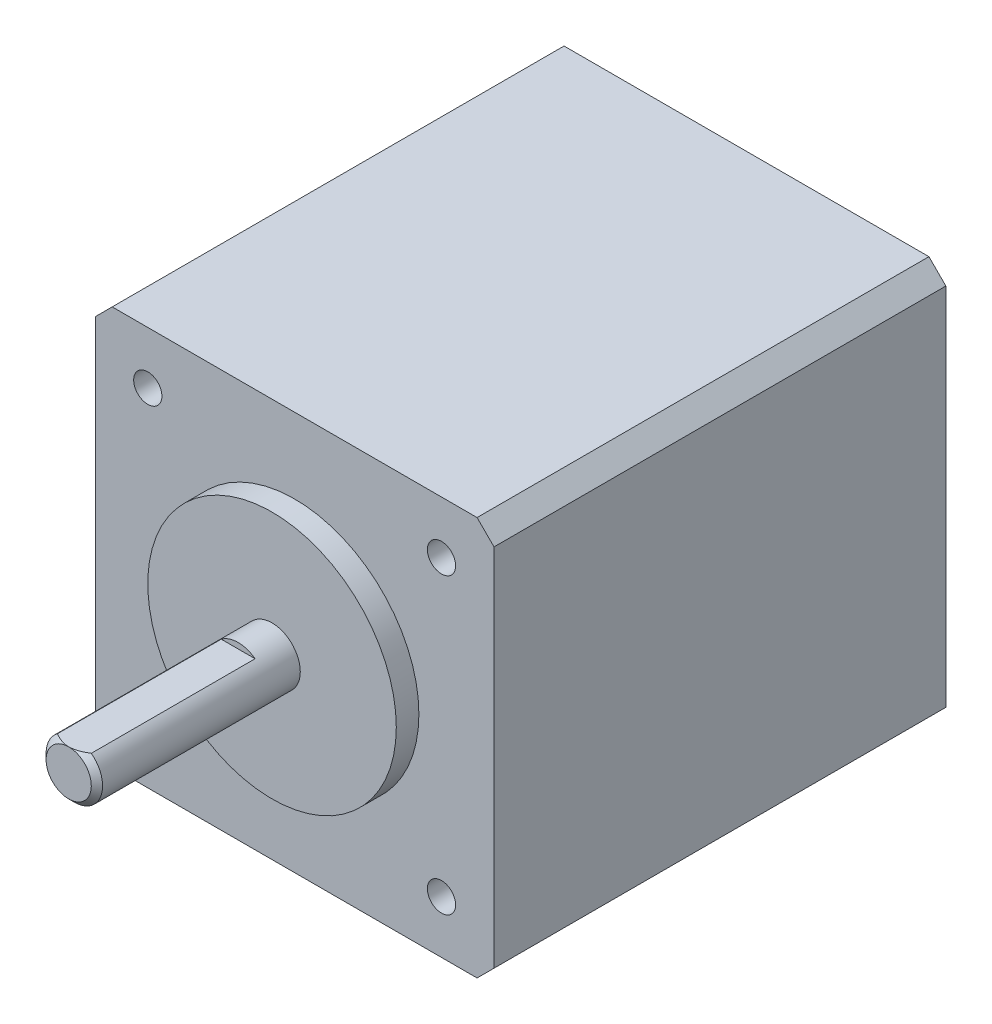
ISO-10303-21;
HEADER;
FILE_DESCRIPTION(('STEP AP214'),'2;1');
FILE_NAME('part.step','',(''),(''),'','','');
FILE_SCHEMA(('AUTOMOTIVE_DESIGN { 1 0 10303 214 1 1 1 1 }'));
ENDSEC;
DATA;
#1=APPLICATION_CONTEXT('core data for automotive mechanical design processes');
#2=APPLICATION_PROTOCOL_DEFINITION('international standard','automotive_design',2000,#1);
#3=PRODUCT_CONTEXT('',#1,'mechanical');
#4=PRODUCT('Part','Part','',(#3));
#5=PRODUCT_RELATED_PRODUCT_CATEGORY('part','',(#4));
#6=PRODUCT_DEFINITION_FORMATION('','',#4);
#7=PRODUCT_DEFINITION_CONTEXT('part definition',#1,'design');
#8=PRODUCT_DEFINITION('design','',#6,#7);
#9=PRODUCT_DEFINITION_SHAPE('','',#8);
#10=(LENGTH_UNIT() NAMED_UNIT(*) SI_UNIT(.MILLI.,.METRE.));
#11=(NAMED_UNIT(*) PLANE_ANGLE_UNIT() SI_UNIT($,.RADIAN.));
#12=(NAMED_UNIT(*) SI_UNIT($,.STERADIAN.) SOLID_ANGLE_UNIT());
#13=UNCERTAINTY_MEASURE_WITH_UNIT(LENGTH_MEASURE(1.E-05),#10,'distance_accuracy_value','');
#14=(GEOMETRIC_REPRESENTATION_CONTEXT(3) GLOBAL_UNCERTAINTY_ASSIGNED_CONTEXT((#13)) GLOBAL_UNIT_ASSIGNED_CONTEXT((#10,
#11,#12)) REPRESENTATION_CONTEXT('',''));
#15=CARTESIAN_POINT('',(0.,0.,0.));
#16=DIRECTION('',(0.,0.,1.));
#17=DIRECTION('',(1.,0.,0.));
#18=AXIS2_PLACEMENT_3D('',#15,#16,#17);
#19=CARTESIAN_POINT('',(0.,0.,0.));
#20=DIRECTION('',(0.,0.,1.));
#21=DIRECTION('',(1.,0.,0.));
#22=AXIS2_PLACEMENT_3D('',#19,#20,#21);
#23=PLANE('',#22);
#24=CARTESIAN_POINT('',(0.,0.,0.));
#25=DIRECTION('',(0.,0.,1.));
#26=DIRECTION('',(1.,0.,0.));
#27=AXIS2_PLACEMENT_3D('',#24,#25,#26);
#28=CIRCLE('',#27,11.);
#29=CARTESIAN_POINT('',(11.,0.,0.));
#30=VERTEX_POINT('',#29);
#31=EDGE_CURVE('E232',#30,#30,#28,.T.);
#32=ORIENTED_EDGE('',*,*,#31,.T.);
#33=EDGE_LOOP('',(#32));
#34=FACE_BOUND('',#33,.T.);
#35=CARTESIAN_POINT('',(0.,0.,0.));
#36=DIRECTION('',(0.,0.,1.));
#37=DIRECTION('',(1.,0.,0.));
#38=AXIS2_PLACEMENT_3D('',#35,#36,#37);
#39=CIRCLE('',#38,2.5);
#40=CARTESIAN_POINT('',(2.5,0.,0.));
#41=VERTEX_POINT('',#40);
#42=EDGE_CURVE('E229',#41,#41,#39,.T.);
#43=ORIENTED_EDGE('',*,*,#42,.F.);
#44=EDGE_LOOP('',(#43));
#45=FACE_BOUND('',#44,.T.);
#46=ADVANCED_FACE('F39',(#34,#45),#23,.T.);
#47=CARTESIAN_POINT('',(0.,0.,-2.));
#48=DIRECTION('',(0.,0.,1.));
#49=DIRECTION('',(1.,0.,0.));
#50=AXIS2_PLACEMENT_3D('',#47,#48,#49);
#51=CYLINDRICAL_SURFACE('',#50,11.);
#52=CARTESIAN_POINT('',(0.,0.,-2.));
#53=DIRECTION('',(0.,0.,1.));
#54=DIRECTION('',(1.,0.,0.));
#55=AXIS2_PLACEMENT_3D('',#52,#53,#54);
#56=CIRCLE('',#55,11.);
#57=CARTESIAN_POINT('',(11.,0.,-2.));
#58=VERTEX_POINT('',#57);
#59=EDGE_CURVE('E219',#58,#58,#56,.F.);
#60=ORIENTED_EDGE('',*,*,#59,.F.);
#61=EDGE_LOOP('',(#60));
#62=FACE_BOUND('',#61,.T.);
#63=ORIENTED_EDGE('',*,*,#31,.F.);
#64=EDGE_LOOP('',(#63));
#65=FACE_BOUND('',#64,.T.);
#66=ADVANCED_FACE('F265',(#62,#65),#51,.T.);
#67=CARTESIAN_POINT('',(0.,0.,18.));
#68=DIRECTION('',(0.,0.,-1.));
#69=DIRECTION('',(-1.,0.,0.));
#70=AXIS2_PLACEMENT_3D('',#67,#68,#69);
#71=CYLINDRICAL_SURFACE('',#70,2.5);
#72=DIRECTION('',(0.,0.,-1.));
#73=VECTOR('',#72,1.);
#74=CARTESIAN_POINT('',(1.5,2.,18.));
#75=LINE('',#74,#73);
#76=CARTESIAN_POINT('',(1.5,2.,3.));
#77=VERTEX_POINT('',#76);
#78=CARTESIAN_POINT('',(1.5,2.,17.5));
#79=VERTEX_POINT('',#78);
#80=EDGE_CURVE('E225',#77,#79,#75,.F.);
#81=ORIENTED_EDGE('',*,*,#80,.T.);
#82=CARTESIAN_POINT('',(0.,0.,17.5));
#83=DIRECTION('',(0.,0.,1.));
#84=DIRECTION('',(1.,0.,0.));
#85=AXIS2_PLACEMENT_3D('',#82,#83,#84);
#86=CIRCLE('',#85,2.5);
#87=CARTESIAN_POINT('',(-1.5,2.,17.5));
#88=VERTEX_POINT('',#87);
#89=EDGE_CURVE('E11',#79,#88,#86,.F.);
#90=ORIENTED_EDGE('',*,*,#89,.T.);
#91=DIRECTION('',(0.,0.,-1.));
#92=VECTOR('',#91,1.);
#93=CARTESIAN_POINT('',(-1.5,2.,18.));
#94=LINE('',#93,#92);
#95=CARTESIAN_POINT('',(-1.5,2.,3.));
#96=VERTEX_POINT('',#95);
#97=EDGE_CURVE('E227',#88,#96,#94,.T.);
#98=ORIENTED_EDGE('',*,*,#97,.T.);
#99=CARTESIAN_POINT('',(0.,0.,3.));
#100=DIRECTION('',(0.,0.,1.));
#101=DIRECTION('',(1.,0.,0.));
#102=AXIS2_PLACEMENT_3D('',#99,#100,#101);
#103=CIRCLE('',#102,2.5);
#104=EDGE_CURVE('E235',#77,#96,#103,.T.);
#105=ORIENTED_EDGE('',*,*,#104,.F.);
#106=EDGE_LOOP('',(#81,#90,#98,#105));
#107=FACE_BOUND('',#106,.T.);
#108=ORIENTED_EDGE('',*,*,#42,.T.);
#109=EDGE_LOOP('',(#108));
#110=FACE_BOUND('',#109,.T.);
#111=ADVANCED_FACE('F261',(#107,#110),#71,.T.);
#112=CARTESIAN_POINT('',(0.,0.,18.));
#113=DIRECTION('',(0.,0.,1.));
#114=DIRECTION('',(1.,0.,0.));
#115=AXIS2_PLACEMENT_3D('',#112,#113,#114);
#116=PLANE('',#115);
#117=CARTESIAN_POINT('',(0.,0.,18.));
#118=DIRECTION('',(0.,0.,1.));
#119=DIRECTION('',(1.,0.,0.));
#120=AXIS2_PLACEMENT_3D('',#117,#118,#119);
#121=CIRCLE('',#120,1.99999999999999);
#122=CARTESIAN_POINT('',(0.,2.,18.));
#123=VERTEX_POINT('',#122);
#124=EDGE_CURVE('E238',#123,#123,#121,.T.);
#125=ORIENTED_EDGE('',*,*,#124,.T.);
#126=EDGE_LOOP('',(#125));
#127=FACE_BOUND('',#126,.T.);
#128=ADVANCED_FACE('F257',(#127),#116,.T.);
#129=CARTESIAN_POINT('',(0.,0.,3.));
#130=DIRECTION('',(0.,0.,1.));
#131=DIRECTION('',(1.,0.,0.));
#132=AXIS2_PLACEMENT_3D('',#129,#130,#131);
#133=PLANE('',#132);
#134=ORIENTED_EDGE('',*,*,#104,.T.);
#135=DIRECTION('',(1.,0.,0.));
#136=VECTOR('',#135,1.);
#137=CARTESIAN_POINT('',(-3.25447574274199,2.,3.));
#138=LINE('',#137,#136);
#139=EDGE_CURVE('E222',#96,#77,#138,.T.);
#140=ORIENTED_EDGE('',*,*,#139,.T.);
#141=EDGE_LOOP('',(#134,#140));
#142=FACE_BOUND('',#141,.T.);
#143=ADVANCED_FACE('F255',(#142),#133,.T.);
#144=CARTESIAN_POINT('',(0.,2.,3.));
#145=DIRECTION('',(0.,-1.,0.));
#146=DIRECTION('',(0.,0.,-1.));
#147=AXIS2_PLACEMENT_3D('',#144,#145,#146);
#148=PLANE('',#147);
#149=CARTESIAN_POINT('',(-1.5,2.,17.5));
#150=CARTESIAN_POINT('',(-1.42763018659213,2.,17.5433736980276));
#151=CARTESIAN_POINT('',(-1.35436226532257,2.,17.5853687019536));
#152=CARTESIAN_POINT('',(-1.20549660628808,2.,17.6656443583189));
#153=CARTESIAN_POINT('',(-1.12989157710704,2.,17.7039114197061));
#154=CARTESIAN_POINT('',(-0.978296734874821,2.,17.774534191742));
#155=CARTESIAN_POINT('',(-0.902366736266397,2.,17.8070165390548));
#156=CARTESIAN_POINT('',(-0.748220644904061,2.,17.8658090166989));
#157=CARTESIAN_POINT('',(-0.67000787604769,2.,17.8921276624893));
#158=CARTESIAN_POINT('',(-0.543060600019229,2.,17.9280861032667));
#159=CARTESIAN_POINT('',(-0.495021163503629,2.,17.9401901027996));
#160=CARTESIAN_POINT('',(-0.398260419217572,2.,17.9612794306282));
#161=CARTESIAN_POINT('',(-0.349539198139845,2.,17.9702651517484));
#162=CARTESIAN_POINT('',(-0.250852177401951,2.,17.984927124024));
#163=CARTESIAN_POINT('',(-0.200878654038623,2.,17.9905520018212));
#164=CARTESIAN_POINT('',(-0.100607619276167,2.,17.9981023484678));
#165=CARTESIAN_POINT('',(-0.0503098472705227,2.,18.0000243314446));
#166=CARTESIAN_POINT('',(0.,2.,18.));
#167=B_SPLINE_CURVE_WITH_KNOTS('',3,(#149,#150,#151,#152,#153,#154,#155,#156,#157,#158,#159,
#160,#161,#162,#163,#164,#165,#166),.UNSPECIFIED.,.F.,.F.,(4,2,2,2,2,2,2,2,4),(0.,
0.2531950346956,0.507281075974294,0.754837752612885,1.00205037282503,1.15058504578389,
1.29910100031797,1.44983263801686,1.60070610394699),.UNSPECIFIED.);
#168=EDGE_CURVE('E241',#88,#123,#167,.T.);
#169=ORIENTED_EDGE('',*,*,#168,.T.);
#170=CARTESIAN_POINT('',(0.,1.99999999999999,18.));
#171=CARTESIAN_POINT('',(0.0614966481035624,2.,18.0000514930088));
#172=CARTESIAN_POINT('',(0.12296179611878,2.,17.997164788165));
#173=CARTESIAN_POINT('',(0.245274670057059,2.,17.9859212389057));
#174=CARTESIAN_POINT('',(0.30612336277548,2.,17.9775750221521));
#175=CARTESIAN_POINT('',(0.425885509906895,2.,17.9559969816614));
#176=CARTESIAN_POINT('',(0.484814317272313,2.,17.9428488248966));
#177=CARTESIAN_POINT('',(0.60155552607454,2.,17.9122507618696));
#178=CARTESIAN_POINT('',(0.659367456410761,2.,17.8947990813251));
#179=CARTESIAN_POINT('',(0.78457626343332,2.,17.8525702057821));
#180=CARTESIAN_POINT('',(0.851714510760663,2.,17.8270315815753));
#181=CARTESIAN_POINT('',(0.984250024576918,2.,17.7717452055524));
#182=CARTESIAN_POINT('',(1.04964642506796,2.,17.7419954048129));
#183=CARTESIAN_POINT('',(1.18016546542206,2.,17.6784785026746));
#184=CARTESIAN_POINT('',(1.24525271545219,2.,17.6446394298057));
#185=CARTESIAN_POINT('',(1.37378197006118,2.,17.5742160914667));
#186=CARTESIAN_POINT('',(1.43722666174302,2.,17.5376367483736));
#187=CARTESIAN_POINT('',(1.5,2.,17.5));
#188=B_SPLINE_CURVE_WITH_KNOTS('',3,(#170,#171,#172,#173,#174,#175,#176,#177,#178,#179,#180,
#181,#182,#183,#184,#185,#186,#187),.UNSPECIFIED.,.F.,.F.,(4,2,2,2,2,2,2,2,4),(0.,
0.184371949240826,0.36838605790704,0.549336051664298,0.730360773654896,0.945674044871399,
1.16109243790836,1.38109142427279,1.60070428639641),.UNSPECIFIED.);
#189=EDGE_CURVE('E48',#123,#79,#188,.T.);
#190=ORIENTED_EDGE('',*,*,#189,.T.);
#191=ORIENTED_EDGE('',*,*,#80,.F.);
#192=ORIENTED_EDGE('',*,*,#139,.F.);
#193=ORIENTED_EDGE('',*,*,#97,.F.);
#194=EDGE_LOOP('',(#169,#190,#191,#192,#193));
#195=FACE_BOUND('',#194,.T.);
#196=ADVANCED_FACE('F249',(#195),#148,.F.);
#197=CARTESIAN_POINT('',(17.65,-16.15,-42.));
#198=DIRECTION('',(-1.,0.,0.));
#199=DIRECTION('',(0.,0.,1.));
#200=AXIS2_PLACEMENT_3D('',#197,#198,#199);
#201=PLANE('',#200);
#202=DIRECTION('',(0.,-1.,0.));
#203=VECTOR('',#202,1.);
#204=CARTESIAN_POINT('',(17.65,-16.15,-2.));
#205=LINE('',#204,#203);
#206=CARTESIAN_POINT('',(17.65,16.15,-2.));
#207=VERTEX_POINT('',#206);
#208=CARTESIAN_POINT('',(17.65,-16.15,-2.));
#209=VERTEX_POINT('',#208);
#210=EDGE_CURVE('E160',#207,#209,#205,.T.);
#211=ORIENTED_EDGE('',*,*,#210,.T.);
#212=DIRECTION('',(0.,0.,1.));
#213=VECTOR('',#212,1.);
#214=CARTESIAN_POINT('',(17.65,-16.15,-42.));
#215=LINE('',#214,#213);
#216=CARTESIAN_POINT('',(17.65,-16.15,-42.));
#217=VERTEX_POINT('',#216);
#218=EDGE_CURVE('E216',#217,#209,#215,.T.);
#219=ORIENTED_EDGE('',*,*,#218,.F.);
#220=DIRECTION('',(0.,-1.,0.));
#221=VECTOR('',#220,1.);
#222=CARTESIAN_POINT('',(17.65,-16.15,-42.));
#223=LINE('',#222,#221);
#224=CARTESIAN_POINT('',(17.65,16.15,-42.));
#225=VERTEX_POINT('',#224);
#226=EDGE_CURVE('E161',#225,#217,#223,.T.);
#227=ORIENTED_EDGE('',*,*,#226,.F.);
#228=DIRECTION('',(0.,0.,1.));
#229=VECTOR('',#228,1.);
#230=CARTESIAN_POINT('',(17.65,16.15,-42.));
#231=LINE('',#230,#229);
#232=EDGE_CURVE('E179',#225,#207,#231,.T.);
#233=ORIENTED_EDGE('',*,*,#232,.T.);
#234=EDGE_LOOP('',(#211,#219,#227,#233));
#235=FACE_BOUND('',#234,.T.);
#236=ADVANCED_FACE('F254',(#235),#201,.F.);
#237=CARTESIAN_POINT('',(16.15,-17.65,-42.));
#238=DIRECTION('',(-0.707106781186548,0.707106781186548,0.));
#239=DIRECTION('',(-0.707106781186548,-0.707106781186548,0.));
#240=AXIS2_PLACEMENT_3D('',#237,#238,#239);
#241=PLANE('',#240);
#242=DIRECTION('',(-0.707106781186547,-0.707106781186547,0.));
#243=VECTOR('',#242,1.);
#244=CARTESIAN_POINT('',(16.15,-17.65,-2.));
#245=LINE('',#244,#243);
#246=CARTESIAN_POINT('',(16.15,-17.65,-2.));
#247=VERTEX_POINT('',#246);
#248=EDGE_CURVE('E182',#209,#247,#245,.T.);
#249=ORIENTED_EDGE('',*,*,#248,.T.);
#250=DIRECTION('',(0.,0.,1.));
#251=VECTOR('',#250,1.);
#252=CARTESIAN_POINT('',(16.15,-17.65,-42.));
#253=LINE('',#252,#251);
#254=CARTESIAN_POINT('',(16.15,-17.65,-42.));
#255=VERTEX_POINT('',#254);
#256=EDGE_CURVE('E213',#255,#247,#253,.T.);
#257=ORIENTED_EDGE('',*,*,#256,.F.);
#258=DIRECTION('',(-0.707106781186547,-0.707106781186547,0.));
#259=VECTOR('',#258,1.);
#260=CARTESIAN_POINT('',(16.15,-17.65,-42.));
#261=LINE('',#260,#259);
#262=EDGE_CURVE('E164',#217,#255,#261,.T.);
#263=ORIENTED_EDGE('',*,*,#262,.F.);
#264=ORIENTED_EDGE('',*,*,#218,.T.);
#265=EDGE_LOOP('',(#249,#257,#263,#264));
#266=FACE_BOUND('',#265,.T.);
#267=ADVANCED_FACE('F321',(#266),#241,.F.);
#268=CARTESIAN_POINT('',(-16.15,-17.65,-42.));
#269=DIRECTION('',(0.,1.,0.));
#270=DIRECTION('',(-1.,0.,0.));
#271=AXIS2_PLACEMENT_3D('',#268,#269,#270);
#272=PLANE('',#271);
#273=DIRECTION('',(-1.,0.,0.));
#274=VECTOR('',#273,1.);
#275=CARTESIAN_POINT('',(-16.15,-17.65,-2.));
#276=LINE('',#275,#274);
#277=CARTESIAN_POINT('',(-16.15,-17.65,-2.));
#278=VERTEX_POINT('',#277);
#279=EDGE_CURVE('E184',#247,#278,#276,.T.);
#280=ORIENTED_EDGE('',*,*,#279,.T.);
#281=DIRECTION('',(0.,0.,1.));
#282=VECTOR('',#281,1.);
#283=CARTESIAN_POINT('',(-16.15,-17.65,-42.));
#284=LINE('',#283,#282);
#285=CARTESIAN_POINT('',(-16.15,-17.65,-42.));
#286=VERTEX_POINT('',#285);
#287=EDGE_CURVE('E210',#286,#278,#284,.T.);
#288=ORIENTED_EDGE('',*,*,#287,.F.);
#289=DIRECTION('',(-1.,0.,0.));
#290=VECTOR('',#289,1.);
#291=CARTESIAN_POINT('',(-16.15,-17.65,-42.));
#292=LINE('',#291,#290);
#293=EDGE_CURVE('E167',#255,#286,#292,.T.);
#294=ORIENTED_EDGE('',*,*,#293,.F.);
#295=ORIENTED_EDGE('',*,*,#256,.T.);
#296=EDGE_LOOP('',(#280,#288,#294,#295));
#297=FACE_BOUND('',#296,.T.);
#298=ADVANCED_FACE('F318',(#297),#272,.F.);
#299=CARTESIAN_POINT('',(-17.65,-16.15,-42.));
#300=DIRECTION('',(0.707106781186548,0.707106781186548,0.));
#301=DIRECTION('',(-0.707106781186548,0.707106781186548,0.));
#302=AXIS2_PLACEMENT_3D('',#299,#300,#301);
#303=PLANE('',#302);
#304=DIRECTION('',(-0.707106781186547,0.707106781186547,0.));
#305=VECTOR('',#304,1.);
#306=CARTESIAN_POINT('',(-17.65,-16.15,-2.));
#307=LINE('',#306,#305);
#308=CARTESIAN_POINT('',(-17.65,-16.15,-2.));
#309=VERTEX_POINT('',#308);
#310=EDGE_CURVE('E186',#278,#309,#307,.T.);
#311=ORIENTED_EDGE('',*,*,#310,.T.);
#312=DIRECTION('',(0.,0.,1.));
#313=VECTOR('',#312,1.);
#314=CARTESIAN_POINT('',(-17.65,-16.15,-42.));
#315=LINE('',#314,#313);
#316=CARTESIAN_POINT('',(-17.65,-16.15,-42.));
#317=VERTEX_POINT('',#316);
#318=EDGE_CURVE('E207',#317,#309,#315,.T.);
#319=ORIENTED_EDGE('',*,*,#318,.F.);
#320=DIRECTION('',(-0.707106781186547,0.707106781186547,0.));
#321=VECTOR('',#320,1.);
#322=CARTESIAN_POINT('',(-17.65,-16.15,-42.));
#323=LINE('',#322,#321);
#324=EDGE_CURVE('E169',#286,#317,#323,.T.);
#325=ORIENTED_EDGE('',*,*,#324,.F.);
#326=ORIENTED_EDGE('',*,*,#287,.T.);
#327=EDGE_LOOP('',(#311,#319,#325,#326));
#328=FACE_BOUND('',#327,.T.);
#329=ADVANCED_FACE('F313',(#328),#303,.F.);
#330=CARTESIAN_POINT('',(-17.65,16.15,-42.));
#331=DIRECTION('',(1.,0.,0.));
#332=DIRECTION('',(0.,1.,0.));
#333=AXIS2_PLACEMENT_3D('',#330,#331,#332);
#334=PLANE('',#333);
#335=DIRECTION('',(0.,1.,0.));
#336=VECTOR('',#335,1.);
#337=CARTESIAN_POINT('',(-17.65,16.15,-2.));
#338=LINE('',#337,#336);
#339=CARTESIAN_POINT('',(-17.65,16.15,-2.));
#340=VERTEX_POINT('',#339);
#341=EDGE_CURVE('E188',#309,#340,#338,.T.);
#342=ORIENTED_EDGE('',*,*,#341,.T.);
#343=DIRECTION('',(0.,0.,1.));
#344=VECTOR('',#343,1.);
#345=CARTESIAN_POINT('',(-17.65,16.15,-42.));
#346=LINE('',#345,#344);
#347=CARTESIAN_POINT('',(-17.65,16.15,-42.));
#348=VERTEX_POINT('',#347);
#349=EDGE_CURVE('E204',#348,#340,#346,.T.);
#350=ORIENTED_EDGE('',*,*,#349,.F.);
#351=DIRECTION('',(0.,1.,0.));
#352=VECTOR('',#351,1.);
#353=CARTESIAN_POINT('',(-17.65,16.15,-42.));
#354=LINE('',#353,#352);
#355=EDGE_CURVE('E171',#317,#348,#354,.T.);
#356=ORIENTED_EDGE('',*,*,#355,.F.);
#357=ORIENTED_EDGE('',*,*,#318,.T.);
#358=EDGE_LOOP('',(#342,#350,#356,#357));
#359=FACE_BOUND('',#358,.T.);
#360=ADVANCED_FACE('F309',(#359),#334,.F.);
#361=CARTESIAN_POINT('',(-16.15,17.65,-42.));
#362=DIRECTION('',(0.707106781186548,-0.707106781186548,0.));
#363=DIRECTION('',(0.707106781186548,0.707106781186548,0.));
#364=AXIS2_PLACEMENT_3D('',#361,#362,#363);
#365=PLANE('',#364);
#366=DIRECTION('',(0.707106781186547,0.707106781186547,0.));
#367=VECTOR('',#366,1.);
#368=CARTESIAN_POINT('',(-16.15,17.65,-2.));
#369=LINE('',#368,#367);
#370=CARTESIAN_POINT('',(-16.15,17.65,-2.));
#371=VERTEX_POINT('',#370);
#372=EDGE_CURVE('E190',#340,#371,#369,.T.);
#373=ORIENTED_EDGE('',*,*,#372,.T.);
#374=DIRECTION('',(0.,0.,1.));
#375=VECTOR('',#374,1.);
#376=CARTESIAN_POINT('',(-16.15,17.65,-42.));
#377=LINE('',#376,#375);
#378=CARTESIAN_POINT('',(-16.15,17.65,-42.));
#379=VERTEX_POINT('',#378);
#380=EDGE_CURVE('E201',#379,#371,#377,.T.);
#381=ORIENTED_EDGE('',*,*,#380,.F.);
#382=DIRECTION('',(0.707106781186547,0.707106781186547,0.));
#383=VECTOR('',#382,1.);
#384=CARTESIAN_POINT('',(-16.15,17.65,-42.));
#385=LINE('',#384,#383);
#386=EDGE_CURVE('E173',#348,#379,#385,.T.);
#387=ORIENTED_EDGE('',*,*,#386,.F.);
#388=ORIENTED_EDGE('',*,*,#349,.T.);
#389=EDGE_LOOP('',(#373,#381,#387,#388));
#390=FACE_BOUND('',#389,.T.);
#391=ADVANCED_FACE('F304',(#390),#365,.F.);
#392=CARTESIAN_POINT('',(16.15,17.65,-42.));
#393=DIRECTION('',(0.,-1.,0.));
#394=DIRECTION('',(1.,0.,0.));
#395=AXIS2_PLACEMENT_3D('',#392,#393,#394);
#396=PLANE('',#395);
#397=DIRECTION('',(1.,0.,0.));
#398=VECTOR('',#397,1.);
#399=CARTESIAN_POINT('',(16.15,17.65,-2.));
#400=LINE('',#399,#398);
#401=CARTESIAN_POINT('',(16.15,17.65,-2.));
#402=VERTEX_POINT('',#401);
#403=EDGE_CURVE('E193',#371,#402,#400,.T.);
#404=ORIENTED_EDGE('',*,*,#403,.T.);
#405=DIRECTION('',(0.,0.,1.));
#406=VECTOR('',#405,1.);
#407=CARTESIAN_POINT('',(16.15,17.65,-42.));
#408=LINE('',#407,#406);
#409=CARTESIAN_POINT('',(16.15,17.65,-42.));
#410=VERTEX_POINT('',#409);
#411=EDGE_CURVE('E198',#410,#402,#408,.T.);
#412=ORIENTED_EDGE('',*,*,#411,.F.);
#413=DIRECTION('',(1.,0.,0.));
#414=VECTOR('',#413,1.);
#415=CARTESIAN_POINT('',(0.,17.65,-42.));
#416=LINE('',#415,#414);
#417=EDGE_CURVE('E175',#379,#410,#416,.T.);
#418=ORIENTED_EDGE('',*,*,#417,.F.);
#419=ORIENTED_EDGE('',*,*,#380,.T.);
#420=EDGE_LOOP('',(#404,#412,#418,#419));
#421=FACE_BOUND('',#420,.T.);
#422=ADVANCED_FACE('F299',(#421),#396,.F.);
#423=CARTESIAN_POINT('',(17.65,16.15,-42.));
#424=DIRECTION('',(-0.707106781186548,-0.707106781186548,0.));
#425=DIRECTION('',(0.707106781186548,-0.707106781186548,0.));
#426=AXIS2_PLACEMENT_3D('',#423,#424,#425);
#427=PLANE('',#426);
#428=DIRECTION('',(0.707106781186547,-0.707106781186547,0.));
#429=VECTOR('',#428,1.);
#430=CARTESIAN_POINT('',(17.65,16.15,-2.));
#431=LINE('',#430,#429);
#432=EDGE_CURVE('E165',#402,#207,#431,.T.);
#433=ORIENTED_EDGE('',*,*,#432,.T.);
#434=ORIENTED_EDGE('',*,*,#232,.F.);
#435=DIRECTION('',(0.707106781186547,-0.707106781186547,0.));
#436=VECTOR('',#435,1.);
#437=CARTESIAN_POINT('',(17.65,16.15,-42.));
#438=LINE('',#437,#436);
#439=EDGE_CURVE('E177',#410,#225,#438,.T.);
#440=ORIENTED_EDGE('',*,*,#439,.F.);
#441=ORIENTED_EDGE('',*,*,#411,.T.);
#442=EDGE_LOOP('',(#433,#434,#440,#441));
#443=FACE_BOUND('',#442,.T.);
#444=ADVANCED_FACE('F295',(#443),#427,.F.);
#445=CARTESIAN_POINT('',(0.,0.,-42.));
#446=DIRECTION('',(0.,0.,1.));
#447=DIRECTION('',(1.,0.,0.));
#448=AXIS2_PLACEMENT_3D('',#445,#446,#447);
#449=PLANE('',#448);
#450=ORIENTED_EDGE('',*,*,#226,.T.);
#451=ORIENTED_EDGE('',*,*,#262,.T.);
#452=ORIENTED_EDGE('',*,*,#293,.T.);
#453=ORIENTED_EDGE('',*,*,#324,.T.);
#454=ORIENTED_EDGE('',*,*,#355,.T.);
#455=ORIENTED_EDGE('',*,*,#386,.T.);
#456=ORIENTED_EDGE('',*,*,#417,.T.);
#457=ORIENTED_EDGE('',*,*,#439,.T.);
#458=EDGE_LOOP('',(#450,#451,#452,#453,#454,#455,#456,#457));
#459=FACE_BOUND('',#458,.T.);
#460=ADVANCED_FACE('F283',(#459),#449,.F.);
#461=CARTESIAN_POINT('',(0.,0.,-2.));
#462=DIRECTION('',(0.,0.,1.));
#463=DIRECTION('',(1.,0.,0.));
#464=AXIS2_PLACEMENT_3D('',#461,#462,#463);
#465=PLANE('',#464);
#466=CARTESIAN_POINT('',(-13.,13.,-2.));
#467=DIRECTION('',(0.,0.,1.));
#468=DIRECTION('',(1.,0.,0.));
#469=AXIS2_PLACEMENT_3D('',#466,#467,#468);
#470=CIRCLE('',#469,1.25);
#471=CARTESIAN_POINT('',(-11.75,13.,-2.));
#472=VERTEX_POINT('',#471);
#473=EDGE_CURVE('E138',#472,#472,#470,.T.);
#474=ORIENTED_EDGE('',*,*,#473,.F.);
#475=EDGE_LOOP('',(#474));
#476=FACE_BOUND('',#475,.T.);
#477=CARTESIAN_POINT('',(13.,13.,-2.));
#478=DIRECTION('',(0.,0.,1.));
#479=DIRECTION('',(1.,0.,0.));
#480=AXIS2_PLACEMENT_3D('',#477,#478,#479);
#481=CIRCLE('',#480,1.25);
#482=CARTESIAN_POINT('',(14.25,13.,-2.));
#483=VERTEX_POINT('',#482);
#484=EDGE_CURVE('E137',#483,#483,#481,.T.);
#485=ORIENTED_EDGE('',*,*,#484,.F.);
#486=EDGE_LOOP('',(#485));
#487=FACE_BOUND('',#486,.T.);
#488=CARTESIAN_POINT('',(13.,-13.,-2.));
#489=DIRECTION('',(0.,0.,1.));
#490=DIRECTION('',(1.,0.,0.));
#491=AXIS2_PLACEMENT_3D('',#488,#489,#490);
#492=CIRCLE('',#491,1.25);
#493=CARTESIAN_POINT('',(14.25,-13.,-2.));
#494=VERTEX_POINT('',#493);
#495=EDGE_CURVE('E148',#494,#494,#492,.T.);
#496=ORIENTED_EDGE('',*,*,#495,.F.);
#497=EDGE_LOOP('',(#496));
#498=FACE_BOUND('',#497,.T.);
#499=CARTESIAN_POINT('',(-13.,-13.,-2.));
#500=DIRECTION('',(0.,0.,1.));
#501=DIRECTION('',(1.,0.,0.));
#502=AXIS2_PLACEMENT_3D('',#499,#500,#501);
#503=CIRCLE('',#502,1.25);
#504=CARTESIAN_POINT('',(-11.75,-13.,-2.));
#505=VERTEX_POINT('',#504);
#506=EDGE_CURVE('E154',#505,#505,#503,.T.);
#507=ORIENTED_EDGE('',*,*,#506,.F.);
#508=EDGE_LOOP('',(#507));
#509=FACE_BOUND('',#508,.T.);
#510=ORIENTED_EDGE('',*,*,#59,.T.);
#511=EDGE_LOOP('',(#510));
#512=FACE_BOUND('',#511,.T.);
#513=ORIENTED_EDGE('',*,*,#210,.F.);
#514=ORIENTED_EDGE('',*,*,#432,.F.);
#515=ORIENTED_EDGE('',*,*,#403,.F.);
#516=ORIENTED_EDGE('',*,*,#372,.F.);
#517=ORIENTED_EDGE('',*,*,#341,.F.);
#518=ORIENTED_EDGE('',*,*,#310,.F.);
#519=ORIENTED_EDGE('',*,*,#279,.F.);
#520=ORIENTED_EDGE('',*,*,#248,.F.);
#521=EDGE_LOOP('',(#513,#514,#515,#516,#517,#518,#519,#520));
#522=FACE_BOUND('',#521,.T.);
#523=ADVANCED_FACE('F279',(#476,#487,#498,#509,#512,#522),#465,.T.);
#524=CARTESIAN_POINT('',(-13.,-13.,-7.));
#525=DIRECTION('',(0.,0.,1.));
#526=DIRECTION('',(1.,0.,0.));
#527=AXIS2_PLACEMENT_3D('',#524,#525,#526);
#528=CONICAL_SURFACE('',#527,1.25,1.02974425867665);
#529=CARTESIAN_POINT('',(-13.,-13.,-7.75107577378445));
#530=VERTEX_POINT('',#529);
#531=VERTEX_LOOP('',#530);
#532=FACE_BOUND('',#531,.T.);
#533=CARTESIAN_POINT('',(-13.,-13.,-7.));
#534=DIRECTION('',(0.,0.,1.));
#535=DIRECTION('',(1.,0.,0.));
#536=AXIS2_PLACEMENT_3D('',#533,#534,#535);
#537=CIRCLE('',#536,1.25);
#538=CARTESIAN_POINT('',(-11.75,-13.,-7.));
#539=VERTEX_POINT('',#538);
#540=EDGE_CURVE('E157',#539,#539,#537,.T.);
#541=ORIENTED_EDGE('',*,*,#540,.T.);
#542=EDGE_LOOP('',(#541));
#543=FACE_BOUND('',#542,.T.);
#544=ADVANCED_FACE('F282',(#532,#543),#528,.F.);
#545=CARTESIAN_POINT('',(-13.,-13.,-2.));
#546=DIRECTION('',(0.,0.,1.));
#547=DIRECTION('',(1.,0.,0.));
#548=AXIS2_PLACEMENT_3D('',#545,#546,#547);
#549=CYLINDRICAL_SURFACE('',#548,1.25);
#550=ORIENTED_EDGE('',*,*,#540,.F.);
#551=EDGE_LOOP('',(#550));
#552=FACE_BOUND('',#551,.T.);
#553=ORIENTED_EDGE('',*,*,#506,.T.);
#554=EDGE_LOOP('',(#553));
#555=FACE_BOUND('',#554,.T.);
#556=ADVANCED_FACE('F397',(#552,#555),#549,.F.);
#557=CARTESIAN_POINT('',(13.,-13.,-7.));
#558=DIRECTION('',(0.,0.,1.));
#559=DIRECTION('',(1.,0.,0.));
#560=AXIS2_PLACEMENT_3D('',#557,#558,#559);
#561=CONICAL_SURFACE('',#560,1.25,1.02974425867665);
#562=CARTESIAN_POINT('',(13.,-13.,-7.75107577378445));
#563=VERTEX_POINT('',#562);
#564=VERTEX_LOOP('',#563);
#565=FACE_BOUND('',#564,.T.);
#566=CARTESIAN_POINT('',(13.,-13.,-7.));
#567=DIRECTION('',(0.,0.,1.));
#568=DIRECTION('',(1.,0.,0.));
#569=AXIS2_PLACEMENT_3D('',#566,#567,#568);
#570=CIRCLE('',#569,1.25);
#571=CARTESIAN_POINT('',(14.25,-13.,-7.));
#572=VERTEX_POINT('',#571);
#573=EDGE_CURVE('E151',#572,#572,#570,.T.);
#574=ORIENTED_EDGE('',*,*,#573,.T.);
#575=EDGE_LOOP('',(#574));
#576=FACE_BOUND('',#575,.T.);
#577=ADVANCED_FACE('F407',(#565,#576),#561,.F.);
#578=CARTESIAN_POINT('',(13.,-13.,-2.));
#579=DIRECTION('',(0.,0.,1.));
#580=DIRECTION('',(1.,0.,0.));
#581=AXIS2_PLACEMENT_3D('',#578,#579,#580);
#582=CYLINDRICAL_SURFACE('',#581,1.25);
#583=ORIENTED_EDGE('',*,*,#573,.F.);
#584=EDGE_LOOP('',(#583));
#585=FACE_BOUND('',#584,.T.);
#586=ORIENTED_EDGE('',*,*,#495,.T.);
#587=EDGE_LOOP('',(#586));
#588=FACE_BOUND('',#587,.T.);
#589=ADVANCED_FACE('F418',(#585,#588),#582,.F.);
#590=CARTESIAN_POINT('',(13.,13.,-7.));
#591=DIRECTION('',(0.,0.,1.));
#592=DIRECTION('',(1.,0.,0.));
#593=AXIS2_PLACEMENT_3D('',#590,#591,#592);
#594=CONICAL_SURFACE('',#593,1.25,1.02974425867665);
#595=CARTESIAN_POINT('',(13.,13.,-7.75107577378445));
#596=VERTEX_POINT('',#595);
#597=VERTEX_LOOP('',#596);
#598=FACE_BOUND('',#597,.T.);
#599=CARTESIAN_POINT('',(13.,13.,-7.));
#600=DIRECTION('',(0.,0.,1.));
#601=DIRECTION('',(1.,0.,0.));
#602=AXIS2_PLACEMENT_3D('',#599,#600,#601);
#603=CIRCLE('',#602,1.25);
#604=CARTESIAN_POINT('',(14.25,13.,-7.));
#605=VERTEX_POINT('',#604);
#606=EDGE_CURVE('E141',#605,#605,#603,.T.);
#607=ORIENTED_EDGE('',*,*,#606,.T.);
#608=EDGE_LOOP('',(#607));
#609=FACE_BOUND('',#608,.T.);
#610=ADVANCED_FACE('F428',(#598,#609),#594,.F.);
#611=CARTESIAN_POINT('',(13.,13.,-2.));
#612=DIRECTION('',(0.,0.,1.));
#613=DIRECTION('',(1.,0.,0.));
#614=AXIS2_PLACEMENT_3D('',#611,#612,#613);
#615=CYLINDRICAL_SURFACE('',#614,1.25);
#616=ORIENTED_EDGE('',*,*,#606,.F.);
#617=EDGE_LOOP('',(#616));
#618=FACE_BOUND('',#617,.T.);
#619=ORIENTED_EDGE('',*,*,#484,.T.);
#620=EDGE_LOOP('',(#619));
#621=FACE_BOUND('',#620,.T.);
#622=ADVANCED_FACE('F131',(#618,#621),#615,.F.);
#623=CARTESIAN_POINT('',(-13.,13.,-7.));
#624=DIRECTION('',(0.,0.,1.));
#625=DIRECTION('',(1.,0.,0.));
#626=AXIS2_PLACEMENT_3D('',#623,#624,#625);
#627=CONICAL_SURFACE('',#626,1.25,1.02974425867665);
#628=CARTESIAN_POINT('',(-13.,13.,-7.75107577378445));
#629=VERTEX_POINT('',#628);
#630=VERTEX_LOOP('',#629);
#631=FACE_BOUND('',#630,.T.);
#632=CARTESIAN_POINT('',(-13.,13.,-7.));
#633=DIRECTION('',(0.,0.,1.));
#634=DIRECTION('',(1.,0.,0.));
#635=AXIS2_PLACEMENT_3D('',#632,#633,#634);
#636=CIRCLE('',#635,1.25);
#637=CARTESIAN_POINT('',(-11.75,13.,-7.));
#638=VERTEX_POINT('',#637);
#639=EDGE_CURVE('E135',#638,#638,#636,.T.);
#640=ORIENTED_EDGE('',*,*,#639,.T.);
#641=EDGE_LOOP('',(#640));
#642=FACE_BOUND('',#641,.T.);
#643=ADVANCED_FACE('F127',(#631,#642),#627,.F.);
#644=CARTESIAN_POINT('',(-13.,13.,-2.));
#645=DIRECTION('',(0.,0.,1.));
#646=DIRECTION('',(1.,0.,0.));
#647=AXIS2_PLACEMENT_3D('',#644,#645,#646);
#648=CYLINDRICAL_SURFACE('',#647,1.25);
#649=ORIENTED_EDGE('',*,*,#639,.F.);
#650=EDGE_LOOP('',(#649));
#651=FACE_BOUND('',#650,.T.);
#652=ORIENTED_EDGE('',*,*,#473,.T.);
#653=EDGE_LOOP('',(#652));
#654=FACE_BOUND('',#653,.T.);
#655=ADVANCED_FACE('F130',(#651,#654),#648,.F.);
#656=CARTESIAN_POINT('',(0.,0.,18.));
#657=DIRECTION('',(0.,0.,-1.));
#658=DIRECTION('',(-1.,0.,0.));
#659=AXIS2_PLACEMENT_3D('',#656,#657,#658);
#660=CONICAL_SURFACE('',#659,1.99999999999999,0.785398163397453);
#661=ORIENTED_EDGE('',*,*,#168,.F.);
#662=ORIENTED_EDGE('',*,*,#89,.F.);
#663=ORIENTED_EDGE('',*,*,#189,.F.);
#664=ORIENTED_EDGE('',*,*,#124,.F.);
#665=EDGE_LOOP('',(#661,#662,#663,#664));
#666=FACE_BOUND('',#665,.T.);
#667=ADVANCED_FACE('F41',(#666),#660,.T.);
#668=CLOSED_SHELL('',(#46,#66,#111,#128,#143,#196,#236,#267,#298,#329,#360,#391,#422,#444,#460,
#523,#544,#556,#577,#589,#610,#622,#643,#655,#667));
#669=MANIFOLD_SOLID_BREP('B2',#668);
#670=ADVANCED_BREP_SHAPE_REPRESENTATION('',(#18,#669),#14);
#671=SHAPE_DEFINITION_REPRESENTATION(#9,#670);
ENDSEC;
END-ISO-10303-21;
